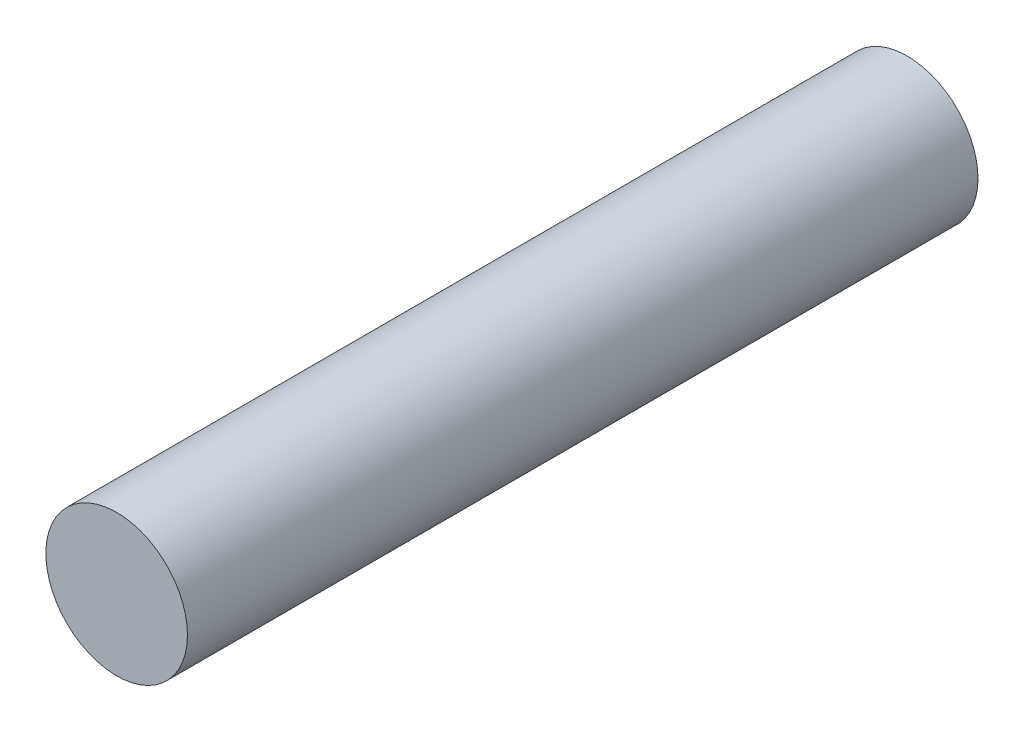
from build123d import *

# Parameters (mm, degrees)
SKETCH1_R           = 0.985
BOSS_EXTRUDE1_DEPTH = 11


with BuildPart() as part:
    # Sketch1 → Boss-Extrude1 (new body)
    with BuildSketch(Plane.XY):
        Circle(SKETCH1_R)
    extrude(amount=BOSS_EXTRUDE1_DEPTH)


solid = part.part
